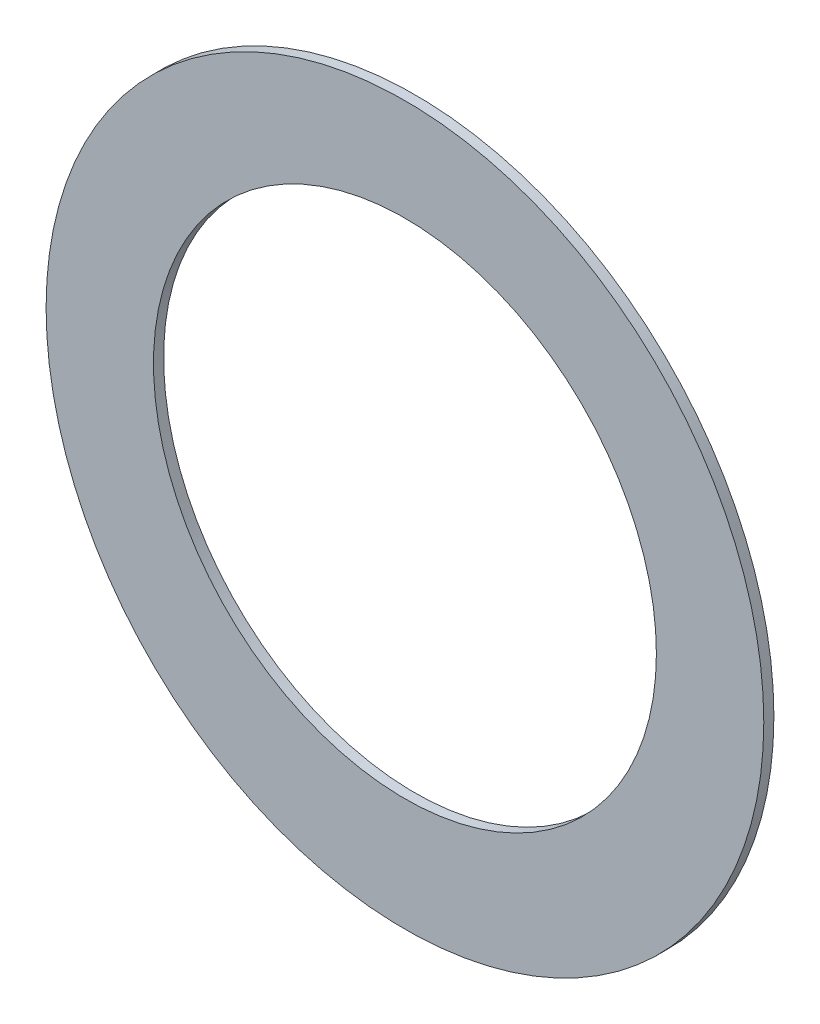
ISO-10303-21;
HEADER;
FILE_DESCRIPTION(('STEP AP214'),'2;1');
FILE_NAME('part.step','',(''),(''),'','','');
FILE_SCHEMA(('AUTOMOTIVE_DESIGN { 1 0 10303 214 1 1 1 1 }'));
ENDSEC;
DATA;
#1=APPLICATION_CONTEXT('core data for automotive mechanical design processes');
#2=APPLICATION_PROTOCOL_DEFINITION('international standard','automotive_design',2000,#1);
#3=PRODUCT_CONTEXT('',#1,'mechanical');
#4=PRODUCT('Part','Part','',(#3));
#5=PRODUCT_RELATED_PRODUCT_CATEGORY('part','',(#4));
#6=PRODUCT_DEFINITION_FORMATION('','',#4);
#7=PRODUCT_DEFINITION_CONTEXT('part definition',#1,'design');
#8=PRODUCT_DEFINITION('design','',#6,#7);
#9=PRODUCT_DEFINITION_SHAPE('','',#8);
#10=(LENGTH_UNIT() NAMED_UNIT(*) SI_UNIT(.MILLI.,.METRE.));
#11=(NAMED_UNIT(*) PLANE_ANGLE_UNIT() SI_UNIT($,.RADIAN.));
#12=(NAMED_UNIT(*) SI_UNIT($,.STERADIAN.) SOLID_ANGLE_UNIT());
#13=UNCERTAINTY_MEASURE_WITH_UNIT(LENGTH_MEASURE(1.E-05),#10,'distance_accuracy_value','');
#14=(GEOMETRIC_REPRESENTATION_CONTEXT(3) GLOBAL_UNCERTAINTY_ASSIGNED_CONTEXT((#13)) GLOBAL_UNIT_ASSIGNED_CONTEXT((#10,
#11,#12)) REPRESENTATION_CONTEXT('',''));
#15=CARTESIAN_POINT('',(0.,0.,0.));
#16=DIRECTION('',(0.,0.,1.));
#17=DIRECTION('',(1.,0.,0.));
#18=AXIS2_PLACEMENT_3D('',#15,#16,#17);
#19=CARTESIAN_POINT('',(0.,0.,4.));
#20=DIRECTION('',(0.,0.,1.));
#21=DIRECTION('',(1.,0.,0.));
#22=AXIS2_PLACEMENT_3D('',#19,#20,#21);
#23=PLANE('',#22);
#24=CARTESIAN_POINT('',(0.,0.,4.));
#25=DIRECTION('',(0.,0.,1.));
#26=DIRECTION('',(1.,0.,0.));
#27=AXIS2_PLACEMENT_3D('',#24,#25,#26);
#28=CIRCLE('',#27,142.);
#29=CARTESIAN_POINT('',(142.,0.,4.));
#30=VERTEX_POINT('',#29);
#31=EDGE_CURVE('E10',#30,#30,#28,.T.);
#32=ORIENTED_EDGE('',*,*,#31,.T.);
#33=EDGE_LOOP('',(#32));
#34=FACE_BOUND('',#33,.T.);
#35=CARTESIAN_POINT('',(0.,2.20380901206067,4.));
#36=DIRECTION('',(0.,0.,1.));
#37=DIRECTION('',(1.,0.,0.));
#38=AXIS2_PLACEMENT_3D('',#35,#36,#37);
#39=CIRCLE('',#38,99.5);
#40=CARTESIAN_POINT('',(99.5,2.20380901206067,4.));
#41=VERTEX_POINT('',#40);
#42=EDGE_CURVE('E42',#41,#41,#39,.T.);
#43=ORIENTED_EDGE('',*,*,#42,.F.);
#44=EDGE_LOOP('',(#43));
#45=FACE_BOUND('',#44,.T.);
#46=ADVANCED_FACE('F31',(#34,#45),#23,.T.);
#47=CARTESIAN_POINT('',(0.,0.,0.));
#48=DIRECTION('',(0.,0.,1.));
#49=DIRECTION('',(1.,0.,0.));
#50=AXIS2_PLACEMENT_3D('',#47,#48,#49);
#51=PLANE('',#50);
#52=CARTESIAN_POINT('',(0.,0.,0.));
#53=DIRECTION('',(0.,0.,1.));
#54=DIRECTION('',(1.,0.,0.));
#55=AXIS2_PLACEMENT_3D('',#52,#53,#54);
#56=CIRCLE('',#55,142.);
#57=CARTESIAN_POINT('',(142.,0.,0.));
#58=VERTEX_POINT('',#57);
#59=EDGE_CURVE('E35',#58,#58,#56,.T.);
#60=ORIENTED_EDGE('',*,*,#59,.F.);
#61=EDGE_LOOP('',(#60));
#62=FACE_BOUND('',#61,.T.);
#63=CARTESIAN_POINT('',(0.,2.20380901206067,0.));
#64=DIRECTION('',(0.,0.,1.));
#65=DIRECTION('',(1.,0.,0.));
#66=AXIS2_PLACEMENT_3D('',#63,#64,#65);
#67=CIRCLE('',#66,99.5);
#68=CARTESIAN_POINT('',(99.5,2.20380901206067,0.));
#69=VERTEX_POINT('',#68);
#70=EDGE_CURVE('E44',#69,#69,#67,.T.);
#71=ORIENTED_EDGE('',*,*,#70,.T.);
#72=EDGE_LOOP('',(#71));
#73=FACE_BOUND('',#72,.T.);
#74=ADVANCED_FACE('F54',(#62,#73),#51,.F.);
#75=CARTESIAN_POINT('',(0.,0.,4.));
#76=DIRECTION('',(0.,0.,-1.));
#77=DIRECTION('',(-1.,0.,0.));
#78=AXIS2_PLACEMENT_3D('',#75,#76,#77);
#79=CYLINDRICAL_SURFACE('',#78,142.);
#80=ORIENTED_EDGE('',*,*,#31,.F.);
#81=EDGE_LOOP('',(#80));
#82=FACE_BOUND('',#81,.T.);
#83=ORIENTED_EDGE('',*,*,#59,.T.);
#84=EDGE_LOOP('',(#83));
#85=FACE_BOUND('',#84,.T.);
#86=ADVANCED_FACE('F33',(#82,#85),#79,.T.);
#87=CARTESIAN_POINT('',(0.,2.20380901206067,4.));
#88=DIRECTION('',(0.,0.,-1.));
#89=DIRECTION('',(-1.,0.,0.));
#90=AXIS2_PLACEMENT_3D('',#87,#88,#89);
#91=CYLINDRICAL_SURFACE('',#90,99.5);
#92=ORIENTED_EDGE('',*,*,#42,.T.);
#93=EDGE_LOOP('',(#92));
#94=FACE_BOUND('',#93,.T.);
#95=ORIENTED_EDGE('',*,*,#70,.F.);
#96=EDGE_LOOP('',(#95));
#97=FACE_BOUND('',#96,.T.);
#98=ADVANCED_FACE('F50',(#94,#97),#91,.F.);
#99=CLOSED_SHELL('',(#46,#74,#86,#98));
#100=MANIFOLD_SOLID_BREP('B2',#99);
#101=ADVANCED_BREP_SHAPE_REPRESENTATION('',(#18,#100),#14);
#102=SHAPE_DEFINITION_REPRESENTATION(#9,#101);
ENDSEC;
END-ISO-10303-21;
